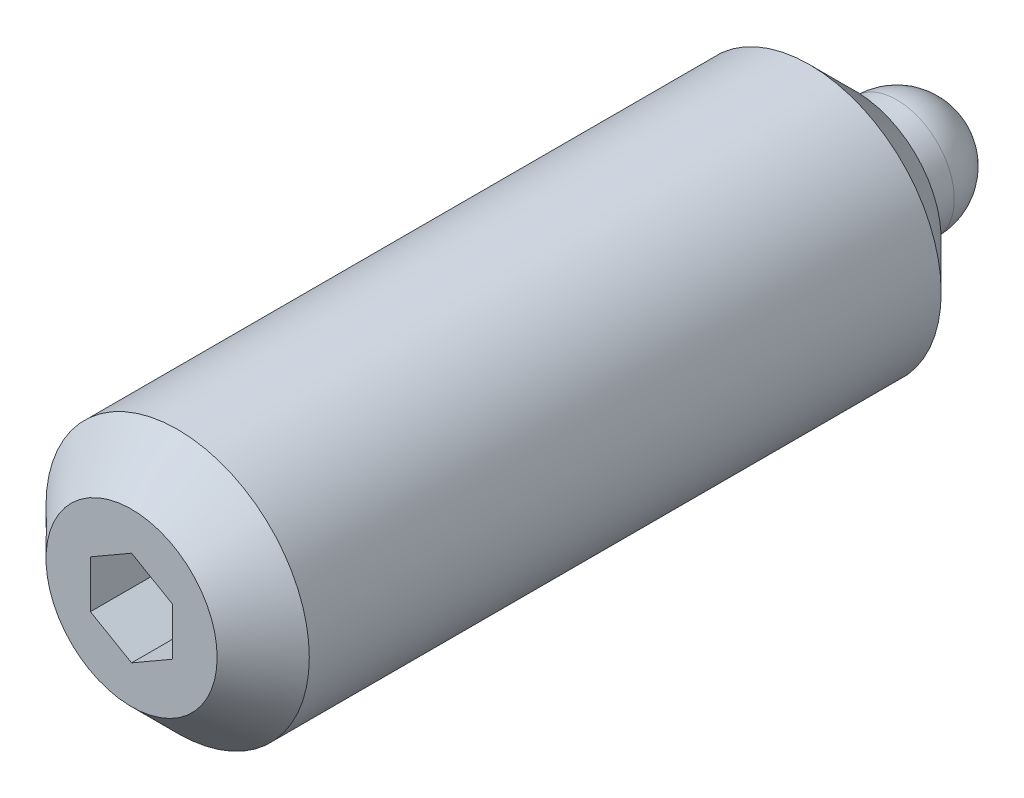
ISO-10303-21;
HEADER;
FILE_DESCRIPTION(('STEP AP214'),'2;1');
FILE_NAME('part.step','',(''),(''),'','','');
FILE_SCHEMA(('AUTOMOTIVE_DESIGN { 1 0 10303 214 1 1 1 1 }'));
ENDSEC;
DATA;
#1=APPLICATION_CONTEXT('core data for automotive mechanical design processes');
#2=APPLICATION_PROTOCOL_DEFINITION('international standard','automotive_design',2000,#1);
#3=PRODUCT_CONTEXT('',#1,'mechanical');
#4=PRODUCT('Part','Part','',(#3));
#5=PRODUCT_RELATED_PRODUCT_CATEGORY('part','',(#4));
#6=PRODUCT_DEFINITION_FORMATION('','',#4);
#7=PRODUCT_DEFINITION_CONTEXT('part definition',#1,'design');
#8=PRODUCT_DEFINITION('design','',#6,#7);
#9=PRODUCT_DEFINITION_SHAPE('','',#8);
#10=(LENGTH_UNIT() NAMED_UNIT(*) SI_UNIT(.MILLI.,.METRE.));
#11=(NAMED_UNIT(*) PLANE_ANGLE_UNIT() SI_UNIT($,.RADIAN.));
#12=(NAMED_UNIT(*) SI_UNIT($,.STERADIAN.) SOLID_ANGLE_UNIT());
#13=UNCERTAINTY_MEASURE_WITH_UNIT(LENGTH_MEASURE(1.E-05),#10,'distance_accuracy_value','');
#14=(GEOMETRIC_REPRESENTATION_CONTEXT(3) GLOBAL_UNCERTAINTY_ASSIGNED_CONTEXT((#13)) GLOBAL_UNIT_ASSIGNED_CONTEXT((#10,
#11,#12)) REPRESENTATION_CONTEXT('',''));
#15=CARTESIAN_POINT('',(0.,0.,0.));
#16=DIRECTION('',(0.,0.,1.));
#17=DIRECTION('',(1.,0.,0.));
#18=AXIS2_PLACEMENT_3D('',#15,#16,#17);
#19=CARTESIAN_POINT('',(0.,4.,25.));
#20=DIRECTION('',(0.,0.,1.));
#21=DIRECTION('',(1.,0.,0.));
#22=AXIS2_PLACEMENT_3D('',#19,#20,#21);
#23=PLANE('',#22);
#24=CARTESIAN_POINT('',(0.,0.,25.));
#25=DIRECTION('',(0.,0.,1.));
#26=DIRECTION('',(1.,0.,0.));
#27=AXIS2_PLACEMENT_3D('',#24,#25,#26);
#28=CIRCLE('',#27,2.6);
#29=CARTESIAN_POINT('',(2.6,0.,25.));
#30=VERTEX_POINT('',#29);
#31=EDGE_CURVE('E9',#30,#30,#28,.T.);
#32=ORIENTED_EDGE('',*,*,#31,.T.);
#33=EDGE_LOOP('',(#32));
#34=FACE_BOUND('',#33,.T.);
#35=DIRECTION('',(0.866025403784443,-0.499999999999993,0.));
#36=VECTOR('',#35,1.);
#37=CARTESIAN_POINT('',(-1.25,-0.721687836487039,25.));
#38=LINE('',#37,#36);
#39=CARTESIAN_POINT('',(-1.25,-0.72168783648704,25.));
#40=VERTEX_POINT('',#39);
#41=CARTESIAN_POINT('',(0.,-1.44337567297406,25.));
#42=VERTEX_POINT('',#41);
#43=EDGE_CURVE('E84',#40,#42,#38,.T.);
#44=ORIENTED_EDGE('',*,*,#43,.F.);
#45=DIRECTION('',(0.,1.,0.));
#46=VECTOR('',#45,1.);
#47=CARTESIAN_POINT('',(-1.25,-0.721687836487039,25.));
#48=LINE('',#47,#46);
#49=CARTESIAN_POINT('',(-1.25,0.721687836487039,25.));
#50=VERTEX_POINT('',#49);
#51=EDGE_CURVE('E29',#40,#50,#48,.T.);
#52=ORIENTED_EDGE('',*,*,#51,.T.);
#53=DIRECTION('',(0.866025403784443,0.499999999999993,0.));
#54=VECTOR('',#53,1.);
#55=CARTESIAN_POINT('',(-1.25,0.721687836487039,25.));
#56=LINE('',#55,#54);
#57=CARTESIAN_POINT('',(0.,1.44337567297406,25.));
#58=VERTEX_POINT('',#57);
#59=EDGE_CURVE('E74',#50,#58,#56,.T.);
#60=ORIENTED_EDGE('',*,*,#59,.T.);
#61=DIRECTION('',(-0.866025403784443,0.499999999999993,0.));
#62=VECTOR('',#61,1.);
#63=CARTESIAN_POINT('',(1.25,0.721687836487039,25.));
#64=LINE('',#63,#62);
#65=CARTESIAN_POINT('',(1.25,0.721687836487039,25.));
#66=VERTEX_POINT('',#65);
#67=EDGE_CURVE('E79',#66,#58,#64,.T.);
#68=ORIENTED_EDGE('',*,*,#67,.F.);
#69=DIRECTION('',(0.,1.,0.));
#70=VECTOR('',#69,1.);
#71=CARTESIAN_POINT('',(1.25,-0.721687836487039,25.));
#72=LINE('',#71,#70);
#73=CARTESIAN_POINT('',(1.25,-0.721687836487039,25.));
#74=VERTEX_POINT('',#73);
#75=EDGE_CURVE('E88',#74,#66,#72,.T.);
#76=ORIENTED_EDGE('',*,*,#75,.F.);
#77=DIRECTION('',(-0.866025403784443,-0.499999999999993,0.));
#78=VECTOR('',#77,1.);
#79=CARTESIAN_POINT('',(1.25,-0.721687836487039,25.));
#80=LINE('',#79,#78);
#81=EDGE_CURVE('E91',#74,#42,#80,.T.);
#82=ORIENTED_EDGE('',*,*,#81,.T.);
#83=EDGE_LOOP('',(#44,#52,#60,#68,#76,#82));
#84=FACE_BOUND('',#83,.T.);
#85=ADVANCED_FACE('F14',(#34,#84),#23,.T.);
#86=CARTESIAN_POINT('',(0.,0.,1.75));
#87=DIRECTION('',(-1.,0.,0.));
#88=DIRECTION('',(0.,0.,1.));
#89=AXIS2_PLACEMENT_3D('',#86,#87,#88);
#90=SPHERICAL_SURFACE('',#89,1.75);
#91=CARTESIAN_POINT('',(0.,0.,1.75));
#92=DIRECTION('',(0.,0.,-1.));
#93=DIRECTION('',(-1.,0.,0.));
#94=AXIS2_PLACEMENT_3D('',#91,#92,#93);
#95=SPHERICAL_SURFACE('',#94,1.75);
#96=CARTESIAN_POINT('',(0.,0.,1.75));
#97=DIRECTION('',(0.,0.,-1.));
#98=DIRECTION('',(-1.,0.,0.));
#99=AXIS2_PLACEMENT_3D('',#96,#97,#98);
#100=CIRCLE('',#99,1.75);
#101=CARTESIAN_POINT('',(-1.75,0.,1.75));
#102=VERTEX_POINT('',#101);
#103=EDGE_CURVE('E70',#102,#102,#100,.T.);
#104=ORIENTED_EDGE('',*,*,#103,.T.);
#105=EDGE_LOOP('',(#104));
#106=FACE_BOUND('',#105,.T.);
#107=ADVANCED_FACE('F152',(#106),#95,.T.);
#108=CARTESIAN_POINT('',(0.,0.,-1.));
#109=DIRECTION('',(0.,0.,-1.));
#110=DIRECTION('',(-1.,0.,0.));
#111=AXIS2_PLACEMENT_3D('',#108,#109,#110);
#112=CYLINDRICAL_SURFACE('',#111,4.);
#113=CARTESIAN_POINT('',(0.,0.,4.4));
#114=DIRECTION('',(0.,0.,-1.));
#115=DIRECTION('',(-1.,0.,0.));
#116=AXIS2_PLACEMENT_3D('',#113,#114,#115);
#117=CIRCLE('',#116,4.);
#118=CARTESIAN_POINT('',(-4.,0.,4.4));
#119=VERTEX_POINT('',#118);
#120=EDGE_CURVE('E22',#119,#119,#117,.F.);
#121=ORIENTED_EDGE('',*,*,#120,.T.);
#122=EDGE_LOOP('',(#121));
#123=FACE_BOUND('',#122,.T.);
#124=CARTESIAN_POINT('',(0.,0.,23.6));
#125=DIRECTION('',(0.,0.,1.));
#126=DIRECTION('',(1.,0.,0.));
#127=AXIS2_PLACEMENT_3D('',#124,#125,#126);
#128=CIRCLE('',#127,4.);
#129=CARTESIAN_POINT('',(4.,0.,23.6));
#130=VERTEX_POINT('',#129);
#131=EDGE_CURVE('E125',#130,#130,#128,.F.);
#132=ORIENTED_EDGE('',*,*,#131,.T.);
#133=EDGE_LOOP('',(#132));
#134=FACE_BOUND('',#133,.T.);
#135=ADVANCED_FACE('F130',(#123,#134),#112,.T.);
#136=CARTESIAN_POINT('',(0.,1.75,3.));
#137=DIRECTION('',(0.,0.,-1.));
#138=DIRECTION('',(-1.,0.,0.));
#139=AXIS2_PLACEMENT_3D('',#136,#137,#138);
#140=PLANE('',#139);
#141=CARTESIAN_POINT('',(0.,0.,3.));
#142=DIRECTION('',(0.,0.,-1.));
#143=DIRECTION('',(-1.,0.,0.));
#144=AXIS2_PLACEMENT_3D('',#141,#142,#143);
#145=CIRCLE('',#144,2.6);
#146=CARTESIAN_POINT('',(-2.6,0.,3.));
#147=VERTEX_POINT('',#146);
#148=EDGE_CURVE('E122',#147,#147,#145,.T.);
#149=ORIENTED_EDGE('',*,*,#148,.T.);
#150=EDGE_LOOP('',(#149));
#151=FACE_BOUND('',#150,.T.);
#152=CARTESIAN_POINT('',(0.,0.,3.));
#153=DIRECTION('',(0.,0.,-1.));
#154=DIRECTION('',(-1.,0.,0.));
#155=AXIS2_PLACEMENT_3D('',#152,#153,#154);
#156=CIRCLE('',#155,1.75);
#157=CARTESIAN_POINT('',(-1.75,0.,3.));
#158=VERTEX_POINT('',#157);
#159=EDGE_CURVE('E119',#158,#158,#156,.T.);
#160=ORIENTED_EDGE('',*,*,#159,.F.);
#161=EDGE_LOOP('',(#160));
#162=FACE_BOUND('',#161,.T.);
#163=ADVANCED_FACE('F140',(#151,#162),#140,.T.);
#164=CARTESIAN_POINT('',(0.,0.,-1.));
#165=DIRECTION('',(0.,0.,-1.));
#166=DIRECTION('',(-1.,0.,0.));
#167=AXIS2_PLACEMENT_3D('',#164,#165,#166);
#168=CYLINDRICAL_SURFACE('',#167,1.75);
#169=ORIENTED_EDGE('',*,*,#159,.T.);
#170=EDGE_LOOP('',(#169));
#171=FACE_BOUND('',#170,.T.);
#172=ORIENTED_EDGE('',*,*,#103,.F.);
#173=EDGE_LOOP('',(#172));
#174=FACE_BOUND('',#173,.T.);
#175=ADVANCED_FACE('F143',(#171,#174),#168,.T.);
#176=CARTESIAN_POINT('',(-1.25,-0.721687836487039,22.));
#177=DIRECTION('',(1.,0.,0.));
#178=DIRECTION('',(0.,0.,-1.));
#179=AXIS2_PLACEMENT_3D('',#176,#177,#178);
#180=PLANE('',#179);
#181=DIRECTION('',(0.,0.,1.));
#182=VECTOR('',#181,1.);
#183=CARTESIAN_POINT('',(-1.25,0.721687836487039,22.));
#184=LINE('',#183,#182);
#185=CARTESIAN_POINT('',(-1.25,0.721687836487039,22.));
#186=VERTEX_POINT('',#185);
#187=EDGE_CURVE('E63',#186,#50,#184,.T.);
#188=ORIENTED_EDGE('',*,*,#187,.T.);
#189=ORIENTED_EDGE('',*,*,#51,.F.);
#190=DIRECTION('',(0.,0.,1.));
#191=VECTOR('',#190,1.);
#192=CARTESIAN_POINT('',(-1.25,-0.721687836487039,22.));
#193=LINE('',#192,#191);
#194=CARTESIAN_POINT('',(-1.25,-0.721687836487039,22.));
#195=VERTEX_POINT('',#194);
#196=EDGE_CURVE('E33',#195,#40,#193,.T.);
#197=ORIENTED_EDGE('',*,*,#196,.F.);
#198=DIRECTION('',(0.,1.,0.));
#199=VECTOR('',#198,1.);
#200=CARTESIAN_POINT('',(-1.25,-0.721687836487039,22.));
#201=LINE('',#200,#199);
#202=EDGE_CURVE('E66',#195,#186,#201,.T.);
#203=ORIENTED_EDGE('',*,*,#202,.T.);
#204=EDGE_LOOP('',(#188,#189,#197,#203));
#205=FACE_BOUND('',#204,.T.);
#206=ADVANCED_FACE('F65',(#205),#180,.T.);
#207=CARTESIAN_POINT('',(-1.25,0.721687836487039,22.));
#208=DIRECTION('',(0.499999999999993,-0.866025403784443,0.));
#209=DIRECTION('',(0.866025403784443,0.499999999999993,0.));
#210=AXIS2_PLACEMENT_3D('',#207,#208,#209);
#211=PLANE('',#210);
#212=DIRECTION('',(0.,0.,1.));
#213=VECTOR('',#212,1.);
#214=CARTESIAN_POINT('',(0.,1.44337567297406,22.));
#215=LINE('',#214,#213);
#216=CARTESIAN_POINT('',(0.,1.44337567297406,22.));
#217=VERTEX_POINT('',#216);
#218=EDGE_CURVE('E71',#217,#58,#215,.T.);
#219=ORIENTED_EDGE('',*,*,#218,.T.);
#220=ORIENTED_EDGE('',*,*,#59,.F.);
#221=ORIENTED_EDGE('',*,*,#187,.F.);
#222=DIRECTION('',(0.866025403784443,0.499999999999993,0.));
#223=VECTOR('',#222,1.);
#224=CARTESIAN_POINT('',(-1.25,0.721687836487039,22.));
#225=LINE('',#224,#223);
#226=EDGE_CURVE('E95',#186,#217,#225,.T.);
#227=ORIENTED_EDGE('',*,*,#226,.T.);
#228=EDGE_LOOP('',(#219,#220,#221,#227));
#229=FACE_BOUND('',#228,.T.);
#230=ADVANCED_FACE('F75',(#229),#211,.T.);
#231=CARTESIAN_POINT('',(1.25,0.721687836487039,22.));
#232=DIRECTION('',(0.499999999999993,0.866025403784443,0.));
#233=DIRECTION('',(-0.866025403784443,0.499999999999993,0.));
#234=AXIS2_PLACEMENT_3D('',#231,#232,#233);
#235=PLANE('',#234);
#236=DIRECTION('',(0.,0.,1.));
#237=VECTOR('',#236,1.);
#238=CARTESIAN_POINT('',(1.25,0.721687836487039,22.));
#239=LINE('',#238,#237);
#240=CARTESIAN_POINT('',(1.25,0.721687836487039,22.));
#241=VERTEX_POINT('',#240);
#242=EDGE_CURVE('E114',#241,#66,#239,.T.);
#243=ORIENTED_EDGE('',*,*,#242,.T.);
#244=ORIENTED_EDGE('',*,*,#67,.T.);
#245=ORIENTED_EDGE('',*,*,#218,.F.);
#246=DIRECTION('',(-0.866025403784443,0.499999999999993,0.));
#247=VECTOR('',#246,1.);
#248=CARTESIAN_POINT('',(1.25,0.721687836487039,22.));
#249=LINE('',#248,#247);
#250=EDGE_CURVE('E97',#241,#217,#249,.T.);
#251=ORIENTED_EDGE('',*,*,#250,.F.);
#252=EDGE_LOOP('',(#243,#244,#245,#251));
#253=FACE_BOUND('',#252,.T.);
#254=ADVANCED_FACE('F166',(#253),#235,.F.);
#255=CARTESIAN_POINT('',(1.25,-0.721687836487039,22.));
#256=DIRECTION('',(1.,0.,0.));
#257=DIRECTION('',(0.,0.,-1.));
#258=AXIS2_PLACEMENT_3D('',#255,#256,#257);
#259=PLANE('',#258);
#260=DIRECTION('',(0.,0.,1.));
#261=VECTOR('',#260,1.);
#262=CARTESIAN_POINT('',(1.25,-0.721687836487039,22.));
#263=LINE('',#262,#261);
#264=CARTESIAN_POINT('',(1.25,-0.721687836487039,22.));
#265=VERTEX_POINT('',#264);
#266=EDGE_CURVE('E112',#265,#74,#263,.T.);
#267=ORIENTED_EDGE('',*,*,#266,.T.);
#268=ORIENTED_EDGE('',*,*,#75,.T.);
#269=ORIENTED_EDGE('',*,*,#242,.F.);
#270=DIRECTION('',(0.,1.,0.));
#271=VECTOR('',#270,1.);
#272=CARTESIAN_POINT('',(1.25,-0.721687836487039,22.));
#273=LINE('',#272,#271);
#274=EDGE_CURVE('E100',#265,#241,#273,.T.);
#275=ORIENTED_EDGE('',*,*,#274,.F.);
#276=EDGE_LOOP('',(#267,#268,#269,#275));
#277=FACE_BOUND('',#276,.T.);
#278=ADVANCED_FACE('F169',(#277),#259,.F.);
#279=CARTESIAN_POINT('',(1.25,-0.721687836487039,22.));
#280=DIRECTION('',(-0.499999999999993,0.866025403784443,0.));
#281=DIRECTION('',(-0.866025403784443,-0.499999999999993,0.));
#282=AXIS2_PLACEMENT_3D('',#279,#280,#281);
#283=PLANE('',#282);
#284=DIRECTION('',(0.,0.,1.));
#285=VECTOR('',#284,1.);
#286=CARTESIAN_POINT('',(0.,-1.44337567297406,22.));
#287=LINE('',#286,#285);
#288=CARTESIAN_POINT('',(0.,-1.44337567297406,22.));
#289=VERTEX_POINT('',#288);
#290=EDGE_CURVE('E110',#289,#42,#287,.T.);
#291=ORIENTED_EDGE('',*,*,#290,.T.);
#292=ORIENTED_EDGE('',*,*,#81,.F.);
#293=ORIENTED_EDGE('',*,*,#266,.F.);
#294=DIRECTION('',(-0.866025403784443,-0.499999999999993,0.));
#295=VECTOR('',#294,1.);
#296=CARTESIAN_POINT('',(1.25,-0.721687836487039,22.));
#297=LINE('',#296,#295);
#298=EDGE_CURVE('E103',#265,#289,#297,.T.);
#299=ORIENTED_EDGE('',*,*,#298,.T.);
#300=EDGE_LOOP('',(#291,#292,#293,#299));
#301=FACE_BOUND('',#300,.T.);
#302=ADVANCED_FACE('F173',(#301),#283,.T.);
#303=CARTESIAN_POINT('',(-1.25,-0.721687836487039,22.));
#304=DIRECTION('',(-0.499999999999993,-0.866025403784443,0.));
#305=DIRECTION('',(0.866025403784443,-0.499999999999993,0.));
#306=AXIS2_PLACEMENT_3D('',#303,#304,#305);
#307=PLANE('',#306);
#308=DIRECTION('',(0.866025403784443,-0.499999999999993,0.));
#309=VECTOR('',#308,1.);
#310=CARTESIAN_POINT('',(-1.25,-0.721687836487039,22.));
#311=LINE('',#310,#309);
#312=EDGE_CURVE('E106',#195,#289,#311,.T.);
#313=ORIENTED_EDGE('',*,*,#312,.F.);
#314=ORIENTED_EDGE('',*,*,#196,.T.);
#315=ORIENTED_EDGE('',*,*,#43,.T.);
#316=ORIENTED_EDGE('',*,*,#290,.F.);
#317=EDGE_LOOP('',(#313,#314,#315,#316));
#318=FACE_BOUND('',#317,.T.);
#319=ADVANCED_FACE('F137',(#318),#307,.F.);
#320=CARTESIAN_POINT('',(-1.25,2.16506350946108,22.));
#321=DIRECTION('',(0.,0.,1.));
#322=DIRECTION('',(1.,0.,0.));
#323=AXIS2_PLACEMENT_3D('',#320,#321,#322);
#324=PLANE('',#323);
#325=ORIENTED_EDGE('',*,*,#202,.F.);
#326=ORIENTED_EDGE('',*,*,#312,.T.);
#327=ORIENTED_EDGE('',*,*,#298,.F.);
#328=ORIENTED_EDGE('',*,*,#274,.T.);
#329=ORIENTED_EDGE('',*,*,#250,.T.);
#330=ORIENTED_EDGE('',*,*,#226,.F.);
#331=EDGE_LOOP('',(#325,#326,#327,#328,#329,#330));
#332=FACE_BOUND('',#331,.T.);
#333=ADVANCED_FACE('F136',(#332),#324,.T.);
#334=CARTESIAN_POINT('',(0.,0.,3.));
#335=DIRECTION('',(0.,0.,1.));
#336=DIRECTION('',(1.,0.,0.));
#337=AXIS2_PLACEMENT_3D('',#334,#335,#336);
#338=CONICAL_SURFACE('',#337,2.6,0.785398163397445);
#339=ORIENTED_EDGE('',*,*,#120,.F.);
#340=EDGE_LOOP('',(#339));
#341=FACE_BOUND('',#340,.T.);
#342=ORIENTED_EDGE('',*,*,#148,.F.);
#343=EDGE_LOOP('',(#342));
#344=FACE_BOUND('',#343,.T.);
#345=ADVANCED_FACE('F133',(#341,#344),#338,.T.);
#346=CARTESIAN_POINT('',(0.,0.,23.6));
#347=DIRECTION('',(0.,0.,-1.));
#348=DIRECTION('',(-1.,0.,0.));
#349=AXIS2_PLACEMENT_3D('',#346,#347,#348);
#350=CONICAL_SURFACE('',#349,4.,0.785398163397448);
#351=ORIENTED_EDGE('',*,*,#31,.F.);
#352=EDGE_LOOP('',(#351));
#353=FACE_BOUND('',#352,.T.);
#354=ORIENTED_EDGE('',*,*,#131,.F.);
#355=EDGE_LOOP('',(#354));
#356=FACE_BOUND('',#355,.T.);
#357=ADVANCED_FACE('F16',(#353,#356),#350,.T.);
#358=CLOSED_SHELL('',(#85,#107,#135,#163,#175,#206,#230,#254,#278,#302,#319,#333,#345,#357));
#359=MANIFOLD_SOLID_BREP('B1',#358);
#360=ADVANCED_BREP_SHAPE_REPRESENTATION('',(#18,#359),#14);
#361=SHAPE_DEFINITION_REPRESENTATION(#9,#360);
ENDSEC;
END-ISO-10303-21;
